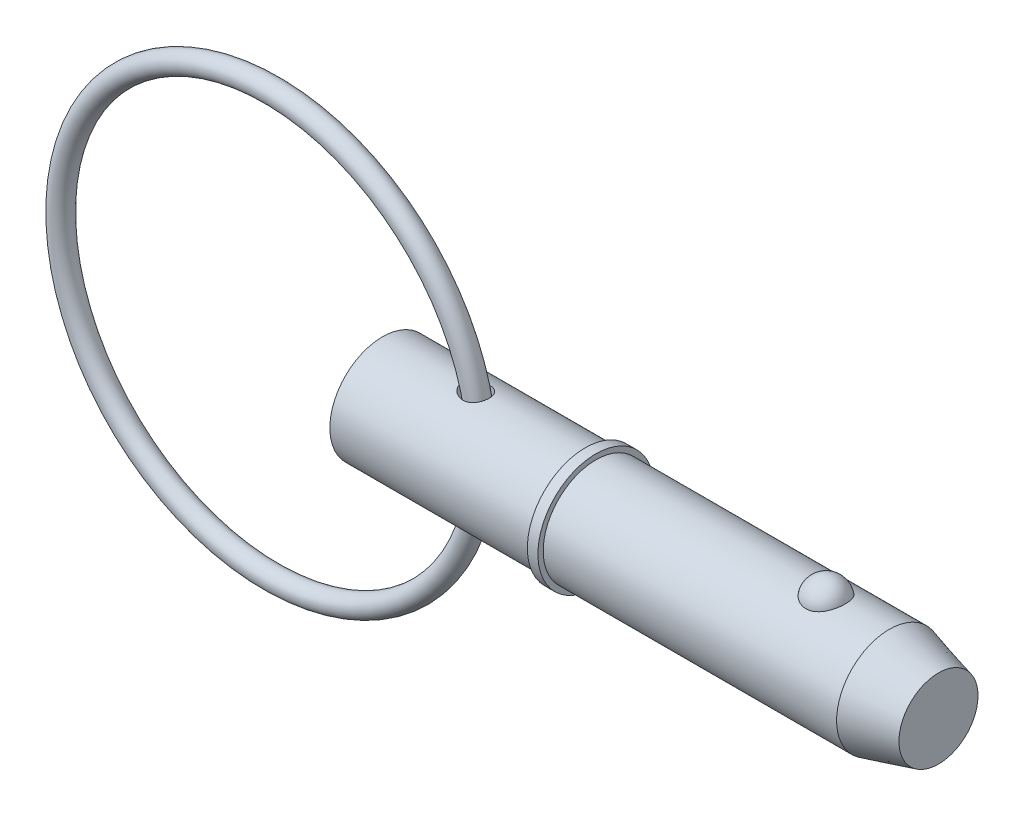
ISO-10303-21;
HEADER;
FILE_DESCRIPTION(('STEP AP214'),'2;1');
FILE_NAME('part.step','',(''),(''),'','','');
FILE_SCHEMA(('AUTOMOTIVE_DESIGN { 1 0 10303 214 1 1 1 1 }'));
ENDSEC;
DATA;
#1=APPLICATION_CONTEXT('core data for automotive mechanical design processes');
#2=APPLICATION_PROTOCOL_DEFINITION('international standard','automotive_design',2000,#1);
#3=PRODUCT_CONTEXT('',#1,'mechanical');
#4=PRODUCT('Part','Part','',(#3));
#5=PRODUCT_RELATED_PRODUCT_CATEGORY('part','',(#4));
#6=PRODUCT_DEFINITION_FORMATION('','',#4);
#7=PRODUCT_DEFINITION_CONTEXT('part definition',#1,'design');
#8=PRODUCT_DEFINITION('design','',#6,#7);
#9=PRODUCT_DEFINITION_SHAPE('','',#8);
#10=(LENGTH_UNIT() NAMED_UNIT(*) SI_UNIT(.MILLI.,.METRE.));
#11=(NAMED_UNIT(*) PLANE_ANGLE_UNIT() SI_UNIT($,.RADIAN.));
#12=(NAMED_UNIT(*) SI_UNIT($,.STERADIAN.) SOLID_ANGLE_UNIT());
#13=UNCERTAINTY_MEASURE_WITH_UNIT(LENGTH_MEASURE(1.E-05),#10,'distance_accuracy_value','');
#14=(GEOMETRIC_REPRESENTATION_CONTEXT(3) GLOBAL_UNCERTAINTY_ASSIGNED_CONTEXT((#13)) GLOBAL_UNIT_ASSIGNED_CONTEXT((#10,
#11,#12)) REPRESENTATION_CONTEXT('',''));
#15=CARTESIAN_POINT('',(0.,0.,0.));
#16=DIRECTION('',(0.,0.,1.));
#17=DIRECTION('',(1.,0.,0.));
#18=AXIS2_PLACEMENT_3D('',#15,#16,#17);
#19=CARTESIAN_POINT('',(-13.3798047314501,0.,0.));
#20=DIRECTION('',(0.,0.,1.));
#21=DIRECTION('',(1.,0.,0.));
#22=AXIS2_PLACEMENT_3D('',#19,#20,#21);
#23=TOROIDAL_SURFACE('',#22,25.4,1.27);
#24=CARTESIAN_POINT('',(13.2901952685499,0.,0.));
#25=VERTEX_POINT('',#24);
#26=VERTEX_LOOP('',#25);
#27=FACE_BOUND('',#26,.T.);
#28=ADVANCED_FACE('P0_F12',(#27),#23,.T.);
#29=CLOSED_SHELL('',(#28));
#30=MANIFOLD_SOLID_BREP('P0_B1',#29);
#31=CARTESIAN_POINT('',(0.,0.,0.));
#32=DIRECTION('',(1.,0.,0.));
#33=DIRECTION('',(0.,0.,-1.));
#34=AXIS2_PLACEMENT_3D('',#31,#32,#33);
#35=CYLINDRICAL_SURFACE('',#34,6.35);
#36=CARTESIAN_POINT('',(9.67500140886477,6.32698634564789,-0.540133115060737));
#37=CARTESIAN_POINT('',(9.70878953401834,6.3197498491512,-0.624879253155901));
#38=CARTESIAN_POINT('',(9.75028044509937,6.31105328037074,-0.706504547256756));
#39=CARTESIAN_POINT('',(9.84659255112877,6.29180070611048,-0.861319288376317));
#40=CARTESIAN_POINT('',(9.90144039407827,6.28124099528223,-0.934491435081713));
#41=CARTESIAN_POINT('',(10.021999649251,6.25949497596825,-1.0704877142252));
#42=CARTESIAN_POINT('',(10.0876589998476,6.2483118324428,-1.13335868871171));
#43=CARTESIAN_POINT('',(10.2280180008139,6.22641783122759,-1.24805262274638));
#44=CARTESIAN_POINT('',(10.3027159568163,6.21570688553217,-1.29987764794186));
#45=CARTESIAN_POINT('',(10.4650889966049,6.19509606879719,-1.39492899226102));
#46=CARTESIAN_POINT('',(10.5533142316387,6.1853135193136,-1.4372443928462));
#47=CARTESIAN_POINT('',(10.7357818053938,6.16871128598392,-1.50691441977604));
#48=CARTESIAN_POINT('',(10.8300253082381,6.16189217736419,-1.53426614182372));
#49=CARTESIAN_POINT('',(11.0227953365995,6.15211299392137,-1.57302798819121));
#50=CARTESIAN_POINT('',(11.1213511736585,6.14918579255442,-1.58430237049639));
#51=CARTESIAN_POINT('',(11.3189518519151,6.1478413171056,-1.58951619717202));
#52=CARTESIAN_POINT('',(11.417996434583,6.14942187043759,-1.58346399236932));
#53=CARTESIAN_POINT('',(11.6070859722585,6.15678569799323,-1.55457003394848));
#54=CARTESIAN_POINT('',(11.6973059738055,6.16229943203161,-1.53280404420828));
#55=CARTESIAN_POINT('',(11.8723373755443,6.17663058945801,-1.4739892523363));
#56=CARTESIAN_POINT('',(11.9571502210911,6.185447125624,-1.43694455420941));
#57=CARTESIAN_POINT('',(12.1146737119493,6.20482821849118,-1.35072170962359));
#58=CARTESIAN_POINT('',(12.1877743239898,6.21528554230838,-1.30222952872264));
#59=CARTESIAN_POINT('',(12.3246187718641,6.23705116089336,-1.19362916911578));
#60=CARTESIAN_POINT('',(12.3883628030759,6.24835943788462,-1.1335212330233));
#61=CARTESIAN_POINT('',(12.5046662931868,6.27053957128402,-1.00357204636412));
#62=CARTESIAN_POINT('',(12.5572571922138,6.28141258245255,-0.933759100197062));
#63=CARTESIAN_POINT('',(12.6502125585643,6.30157953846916,-0.786214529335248));
#64=CARTESIAN_POINT('',(12.6905764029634,6.31087340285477,-0.708482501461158));
#65=CARTESIAN_POINT('',(12.7585531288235,6.32699259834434,-0.546246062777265));
#66=CARTESIAN_POINT('',(12.7860022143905,6.33378599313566,-0.46166981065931));
#67=CARTESIAN_POINT('',(12.8267605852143,6.34401050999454,-0.288980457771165));
#68=CARTESIAN_POINT('',(12.8400695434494,6.34744155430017,-0.200867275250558));
#69=CARTESIAN_POINT('',(12.8522644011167,6.35058177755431,-0.023194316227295));
#70=CARTESIAN_POINT('',(12.8510870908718,6.35027464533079,0.0663700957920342));
#71=CARTESIAN_POINT('',(12.8341831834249,6.34593169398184,0.244024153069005));
#72=CARTESIAN_POINT('',(12.8184563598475,6.341895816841,0.332113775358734));
#73=CARTESIAN_POINT('',(12.7728208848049,6.33052992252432,0.504322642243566));
#74=CARTESIAN_POINT('',(12.7429114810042,6.32319973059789,0.58844167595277));
#75=CARTESIAN_POINT('',(12.6696162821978,6.30604116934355,0.750316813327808));
#76=CARTESIAN_POINT('',(12.6262302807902,6.29621276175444,0.828072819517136));
#77=CARTESIAN_POINT('',(12.5270856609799,6.27515240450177,0.974918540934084));
#78=CARTESIAN_POINT('',(12.4713403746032,6.26392197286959,1.04401746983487));
#79=CARTESIAN_POINT('',(12.3488662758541,6.24131002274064,1.1716478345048));
#80=CARTESIAN_POINT('',(12.2821384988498,6.22992851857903,1.23018026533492));
#81=CARTESIAN_POINT('',(12.1401870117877,6.20841765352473,1.33449214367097));
#82=CARTESIAN_POINT('',(12.0650507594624,6.19827734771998,1.38038832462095));
#83=CARTESIAN_POINT('',(11.9079044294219,6.18026478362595,1.45892404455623));
#84=CARTESIAN_POINT('',(11.8258951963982,6.17239224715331,1.49156520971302));
#85=CARTESIAN_POINT('',(11.6581736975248,6.15982613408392,1.54263810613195));
#86=CARTESIAN_POINT('',(11.572502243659,6.15510409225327,1.56119728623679));
#87=CARTESIAN_POINT('',(11.3991899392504,6.14916283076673,1.58443707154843));
#88=CARTESIAN_POINT('',(11.3115488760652,6.14794399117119,1.58911617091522));
#89=CARTESIAN_POINT('',(11.1345547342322,6.14904466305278,1.58485137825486));
#90=CARTESIAN_POINT('',(11.0452104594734,6.15144894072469,1.5755811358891));
#91=CARTESIAN_POINT('',(10.8691479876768,6.15957601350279,1.54349959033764));
#92=CARTESIAN_POINT('',(10.782430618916,6.16529984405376,1.52068406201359));
#93=CARTESIAN_POINT('',(10.6082848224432,6.17983892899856,1.4605156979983));
#94=CARTESIAN_POINT('',(10.5211557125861,6.1888262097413,1.42233764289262));
#95=CARTESIAN_POINT('',(10.3542377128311,6.20874782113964,1.33268652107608));
#96=CARTESIAN_POINT('',(10.2744521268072,6.21968302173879,1.28120750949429));
#97=CARTESIAN_POINT('',(10.120854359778,6.24282707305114,1.16334748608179));
#98=CARTESIAN_POINT('',(10.0474902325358,6.25507146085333,1.09638652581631));
#99=CARTESIAN_POINT('',(9.9136869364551,6.27890019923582,0.950453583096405));
#100=CARTESIAN_POINT('',(9.85324511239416,6.29048468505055,0.871484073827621));
#101=CARTESIAN_POINT('',(9.75037543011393,6.31102161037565,0.707140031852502));
#102=CARTESIAN_POINT('',(9.70726585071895,6.32006820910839,0.622206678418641));
#103=CARTESIAN_POINT('',(9.63775895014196,6.33497125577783,0.445490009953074));
#104=CARTESIAN_POINT('',(9.61134627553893,6.34083063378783,0.35371307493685));
#105=CARTESIAN_POINT('',(9.57891955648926,6.34807071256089,0.177220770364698));
#106=CARTESIAN_POINT('',(9.57093524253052,6.3498832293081,0.0928817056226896));
#107=CARTESIAN_POINT('',(9.56994851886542,6.35010532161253,-0.0758268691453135));
#108=CARTESIAN_POINT('',(9.57692695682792,6.34851924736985,-0.160196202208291));
#109=CARTESIAN_POINT('',(9.59985709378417,6.34339435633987,-0.294043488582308));
#110=CARTESIAN_POINT('',(9.61128951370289,6.34084912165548,-0.344385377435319));
#111=CARTESIAN_POINT('',(9.63933183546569,6.33468615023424,-0.443526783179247));
#112=CARTESIAN_POINT('',(9.65594100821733,6.33106856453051,-0.492326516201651));
#113=CARTESIAN_POINT('',(9.67500140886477,6.32698634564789,-0.540133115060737));
#114=B_SPLINE_CURVE_WITH_KNOTS('',3,(#36,#37,#38,#39,#40,#41,#42,#43,#44,#45,#46,#47,#48,#49,
#50,#51,#52,#53,#54,#55,#56,#57,#58,#59,#60,#61,#62,#63,#64,#65,#66,#67,#68,#69,#70,#71,#72,#73,
#74,#75,#76,#77,#78,#79,#80,#81,#82,#83,#84,#85,#86,#87,#88,#89,#90,#91,#92,#93,#94,#95,#96,#97,
#98,#99,#100,#101,#102,#103,#104,#105,#106,#107,#108,#109,#110,#111,#112,#113),.UNSPECIFIED.,
.T.,.F.,(4,2,2,2,2,2,2,2,2,2,2,2,2,2,2,2,2,2,2,2,2,2,2,2,2,2,2,2,2,2,2,2,2,2,2,2,2,2,4),(0.,
0.274348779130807,0.549249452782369,0.822863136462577,1.09642560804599,1.39007706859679,
1.68378550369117,1.97995934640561,2.27599046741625,2.55347281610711,2.83088067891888,
3.09465189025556,3.35841759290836,3.62142956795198,3.88445494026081,4.1507318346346,
4.4170148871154,4.68446025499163,4.95190978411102,5.21937350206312,5.48684131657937,
5.75402200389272,6.02117751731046,6.28577524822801,6.55034050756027,6.81248178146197,
7.0746514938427,7.34305086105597,7.61153399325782,7.89692981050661,8.18245340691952,
8.48120635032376,8.77989784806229,9.06530254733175,9.35044442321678,9.60331609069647,
9.85586427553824,10.010650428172,10.1654147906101),.UNSPECIFIED.);
#115=CARTESIAN_POINT('',(9.67500140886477,6.32698634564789,-0.540133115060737));
#116=VERTEX_POINT('',#115);
#117=EDGE_CURVE('P1_E42',#116,#116,#114,.T.);
#118=ORIENTED_EDGE('',*,*,#117,.T.);
#119=EDGE_LOOP('',(#118));
#120=FACE_BOUND('',#119,.T.);
#121=CARTESIAN_POINT('',(0.,0.,0.));
#122=DIRECTION('',(1.,0.,0.));
#123=DIRECTION('',(0.,0.,-1.));
#124=AXIS2_PLACEMENT_3D('',#121,#122,#123);
#125=CIRCLE('',#124,6.35);
#126=CARTESIAN_POINT('',(0.,0.,-6.35));
#127=VERTEX_POINT('',#126);
#128=EDGE_CURVE('P1_E9',#127,#127,#125,.T.);
#129=ORIENTED_EDGE('',*,*,#128,.T.);
#130=EDGE_LOOP('',(#129));
#131=FACE_BOUND('',#130,.T.);
#132=CARTESIAN_POINT('',(24.43,0.,0.));
#133=DIRECTION('',(1.,0.,0.));
#134=DIRECTION('',(0.,0.,-1.));
#135=AXIS2_PLACEMENT_3D('',#132,#133,#134);
#136=CIRCLE('',#135,6.35);
#137=CARTESIAN_POINT('',(24.43,0.,-6.35));
#138=VERTEX_POINT('',#137);
#139=EDGE_CURVE('P1_E25',#138,#138,#136,.T.);
#140=ORIENTED_EDGE('',*,*,#139,.F.);
#141=EDGE_LOOP('',(#140));
#142=FACE_BOUND('',#141,.T.);
#143=CARTESIAN_POINT('',(9.67500140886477,-6.32698634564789,-0.540133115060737));
#144=CARTESIAN_POINT('',(9.64544894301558,-6.33331515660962,-0.466002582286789));
#145=CARTESIAN_POINT('',(9.62177180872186,-6.33852974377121,-0.389437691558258));
#146=CARTESIAN_POINT('',(9.58727043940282,-6.34619174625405,-0.233330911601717));
#147=CARTESIAN_POINT('',(9.57644043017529,-6.34864040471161,-0.153790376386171));
#148=CARTESIAN_POINT('',(9.56819517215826,-6.3505010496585,0.00612071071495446));
#149=CARTESIAN_POINT('',(9.57079639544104,-6.34990930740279,0.0864921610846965));
#150=CARTESIAN_POINT('',(9.58930797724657,-6.3457478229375,0.245607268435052));
#151=CARTESIAN_POINT('',(9.60522046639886,-6.34217760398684,0.324350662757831));
#152=CARTESIAN_POINT('',(9.64931570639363,-6.3324977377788,0.47727605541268));
#153=CARTESIAN_POINT('',(9.67737525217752,-6.32641361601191,0.551495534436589));
#154=CARTESIAN_POINT('',(9.74451510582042,-6.31231128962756,0.694551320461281));
#155=CARTESIAN_POINT('',(9.78359827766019,-6.30429258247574,0.763386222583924));
#156=CARTESIAN_POINT('',(9.87474700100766,-6.28638332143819,0.899414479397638));
#157=CARTESIAN_POINT('',(9.92757481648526,-6.27639669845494,0.966083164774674));
#158=CARTESIAN_POINT('',(10.042675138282,-6.25596164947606,1.09061181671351));
#159=CARTESIAN_POINT('',(10.1049521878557,-6.24551300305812,1.14846751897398));
#160=CARTESIAN_POINT('',(10.2445505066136,-6.22397505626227,1.26024641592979));
#161=CARTESIAN_POINT('',(10.3227711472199,-6.2129394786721,1.31305951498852));
#162=CARTESIAN_POINT('',(10.4867924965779,-6.19263757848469,1.40570084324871));
#163=CARTESIAN_POINT('',(10.5725962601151,-6.18337197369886,1.44552380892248));
#164=CARTESIAN_POINT('',(10.7543302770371,-6.16725983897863,1.51283687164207));
#165=CARTESIAN_POINT('',(10.8505554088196,-6.16056505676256,1.53957358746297));
#166=CARTESIAN_POINT('',(11.0463546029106,-6.15127671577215,1.57628137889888));
#167=CARTESIAN_POINT('',(11.1459276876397,-6.14868197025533,1.58625730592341));
#168=CARTESIAN_POINT('',(11.3414257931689,-6.14810798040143,1.58848000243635));
#169=CARTESIAN_POINT('',(11.4373417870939,-6.14995283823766,1.58140242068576));
#170=CARTESIAN_POINT('',(11.6262783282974,-6.1577972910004,1.55057566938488));
#171=CARTESIAN_POINT('',(11.719300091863,-6.16379511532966,1.52683360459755));
#172=CARTESIAN_POINT('',(11.8934223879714,-6.17873566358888,1.46514575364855));
#173=CARTESIAN_POINT('',(11.9749048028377,-6.18746207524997,1.42822144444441));
#174=CARTESIAN_POINT('',(12.1301362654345,-6.20693584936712,1.3410564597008));
#175=CARTESIAN_POINT('',(12.2038861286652,-6.21768299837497,1.29081719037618));
#176=CARTESIAN_POINT('',(12.3399792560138,-6.23970077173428,1.17972764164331));
#177=CARTESIAN_POINT('',(12.4025430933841,-6.25095401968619,1.11914355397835));
#178=CARTESIAN_POINT('',(12.5166805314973,-6.27296916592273,0.988307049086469));
#179=CARTESIAN_POINT('',(12.568253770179,-6.28373104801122,0.918054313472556));
#180=CARTESIAN_POINT('',(12.6596230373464,-6.3037060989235,0.769081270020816));
#181=CARTESIAN_POINT('',(12.6992956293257,-6.31290263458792,0.690283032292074));
#182=CARTESIAN_POINT('',(12.7652258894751,-6.32862394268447,0.527011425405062));
#183=CARTESIAN_POINT('',(12.7914829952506,-6.33514860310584,0.442537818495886));
#184=CARTESIAN_POINT('',(12.8301436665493,-6.34487485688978,0.269505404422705));
#185=CARTESIAN_POINT('',(12.8424230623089,-6.34804664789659,0.180917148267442));
#186=CARTESIAN_POINT('',(12.8524214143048,-6.35062347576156,0.00286829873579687));
#187=CARTESIAN_POINT('',(12.8501402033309,-6.35002846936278,-0.0865923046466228));
#188=CARTESIAN_POINT('',(12.8310619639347,-6.34513332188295,-0.263931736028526));
#189=CARTESIAN_POINT('',(12.8142517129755,-6.34082980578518,-0.35180904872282));
#190=CARTESIAN_POINT('',(12.7664911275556,-6.32897674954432,-0.523406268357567));
#191=CARTESIAN_POINT('',(12.7355404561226,-6.3214271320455,-0.607126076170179));
#192=CARTESIAN_POINT('',(12.6602298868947,-6.30390232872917,-0.768030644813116));
#193=CARTESIAN_POINT('',(12.6158695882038,-6.29392707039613,-0.84521521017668));
#194=CARTESIAN_POINT('',(12.5148171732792,-6.2726521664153,-0.990836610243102));
#195=CARTESIAN_POINT('',(12.4581254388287,-6.26135256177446,-1.05927371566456));
#196=CARTESIAN_POINT('',(12.33416419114,-6.2387572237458,-1.18510935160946));
#197=CARTESIAN_POINT('',(12.2669484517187,-6.22746174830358,-1.24256086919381));
#198=CARTESIAN_POINT('',(12.1235592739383,-6.20610255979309,-1.34519464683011));
#199=CARTESIAN_POINT('',(12.0473871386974,-6.19603866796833,-1.39037868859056));
#200=CARTESIAN_POINT('',(11.8892714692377,-6.17839642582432,-1.46678006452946));
#201=CARTESIAN_POINT('',(11.8074126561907,-6.17078838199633,-1.49816605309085));
#202=CARTESIAN_POINT('',(11.6394563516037,-6.15869606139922,-1.54712759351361));
#203=CARTESIAN_POINT('',(11.5533589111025,-6.15421174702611,-1.56470331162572));
#204=CARTESIAN_POINT('',(11.3789660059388,-6.14876652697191,-1.58596734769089));
#205=CARTESIAN_POINT('',(11.2906621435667,-6.1478222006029,-1.58959032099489));
#206=CARTESIAN_POINT('',(11.1146029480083,-6.149490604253,-1.58312110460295));
#207=CARTESIAN_POINT('',(11.0268477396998,-6.1521041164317,-1.57302589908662));
#208=CARTESIAN_POINT('',(10.8498668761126,-6.16071031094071,-1.53898332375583));
#209=CARTESIAN_POINT('',(10.7607726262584,-6.16685908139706,-1.51439468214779));
#210=CARTESIAN_POINT('',(10.5876521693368,-6.18189031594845,-1.45181305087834));
#211=CARTESIAN_POINT('',(10.5036282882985,-6.19077402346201,-1.41381396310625));
#212=CARTESIAN_POINT('',(10.3374228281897,-6.2109378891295,-1.32252480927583));
#213=CARTESIAN_POINT('',(10.255708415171,-6.2223355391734,-1.26840756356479));
#214=CARTESIAN_POINT('',(10.1025645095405,-6.24580740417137,-1.14725208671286));
#215=CARTESIAN_POINT('',(10.0311354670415,-6.25788164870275,-1.08021329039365));
#216=CARTESIAN_POINT('',(9.90472699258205,-6.2806176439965,-0.938710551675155));
#217=CARTESIAN_POINT('',(9.84904456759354,-6.29132066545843,-0.864883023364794));
#218=CARTESIAN_POINT('',(9.75129345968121,-6.31084098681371,-0.708496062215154));
#219=CARTESIAN_POINT('',(9.70921094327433,-6.31966019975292,-0.625945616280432));
#220=CARTESIAN_POINT('',(9.67500140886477,-6.32698634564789,-0.540133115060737));
#221=B_SPLINE_CURVE_WITH_KNOTS('',3,(#143,#144,#145,#146,#147,#148,#149,#150,#151,#152,#153,
#154,#155,#156,#157,#158,#159,#160,#161,#162,#163,#164,#165,#166,#167,#168,#169,#170,#171,#172,
#173,#174,#175,#176,#177,#178,#179,#180,#181,#182,#183,#184,#185,#186,#187,#188,#189,#190,#191,
#192,#193,#194,#195,#196,#197,#198,#199,#200,#201,#202,#203,#204,#205,#206,#207,#208,#209,#210,
#211,#212,#213,#214,#215,#216,#217,#218,#219,#220),.UNSPECIFIED.,.T.,.F.,(4,2,2,2,2,2,2,2,2,2,2,
2,2,2,2,2,2,2,2,2,2,2,2,2,2,2,2,2,2,2,2,2,2,2,2,2,2,2,4),(0.,0.239871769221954,
0.479635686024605,0.719693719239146,0.959790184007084,1.19750645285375,1.43528453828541,
1.69117930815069,1.94719750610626,2.23102979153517,2.51497694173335,2.81376497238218,
3.11246650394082,3.39952951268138,3.68647020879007,3.95479420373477,4.22308987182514,
4.48530700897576,4.74753278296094,5.01239119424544,5.27726070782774,5.54446524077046,
5.81167284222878,6.07912387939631,6.34658129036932,6.61404669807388,6.88150382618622,
7.14763644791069,7.41373039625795,7.67647472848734,7.93921589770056,8.20318607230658,
8.46721428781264,8.74390821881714,9.02072813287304,9.31537622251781,9.61003720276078,
9.88799314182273,10.1656654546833),.UNSPECIFIED.);
#222=CARTESIAN_POINT('',(9.67500140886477,-6.32698634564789,-0.540133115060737));
#223=VERTEX_POINT('',#222);
#224=EDGE_CURVE('P1_E17',#223,#223,#221,.T.);
#225=ORIENTED_EDGE('',*,*,#224,.T.);
#226=EDGE_LOOP('',(#225));
#227=FACE_BOUND('',#226,.T.);
#228=ADVANCED_FACE('P1_F13',(#120,#131,#142,#227),#35,.T.);
#229=CARTESIAN_POINT('',(0.,0.,0.));
#230=DIRECTION('',(1.,0.,0.));
#231=DIRECTION('',(0.,0.,-1.));
#232=AXIS2_PLACEMENT_3D('',#229,#230,#231);
#233=CYLINDRICAL_SURFACE('',#232,6.35);
#234=CARTESIAN_POINT('',(61.0553693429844,0.,0.));
#235=DIRECTION('',(1.,0.,0.));
#236=DIRECTION('',(0.,0.,-1.));
#237=AXIS2_PLACEMENT_3D('',#234,#235,#236);
#238=CIRCLE('',#237,6.35);
#239=CARTESIAN_POINT('',(61.0553693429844,0.,-6.35));
#240=VERTEX_POINT('',#239);
#241=EDGE_CURVE('P1_E99',#240,#240,#238,.T.);
#242=ORIENTED_EDGE('',*,*,#241,.F.);
#243=EDGE_LOOP('',(#242));
#244=FACE_BOUND('',#243,.T.);
#245=CARTESIAN_POINT('',(25.7,0.,0.));
#246=DIRECTION('',(1.,0.,0.));
#247=DIRECTION('',(0.,0.,-1.));
#248=AXIS2_PLACEMENT_3D('',#245,#246,#247);
#249=CIRCLE('',#248,6.35);
#250=CARTESIAN_POINT('',(25.7,0.,-6.35));
#251=VERTEX_POINT('',#250);
#252=EDGE_CURVE('P1_E96',#251,#251,#249,.T.);
#253=ORIENTED_EDGE('',*,*,#252,.T.);
#254=EDGE_LOOP('',(#253));
#255=FACE_BOUND('',#254,.T.);
#256=CARTESIAN_POINT('',(53.4300214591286,5.87502187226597,2.40969251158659));
#257=CARTESIAN_POINT('',(53.3050305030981,5.87501645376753,2.40969773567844));
#258=CARTESIAN_POINT('',(53.1800806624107,5.87916061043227,2.39967292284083));
#259=CARTESIAN_POINT('',(52.9339091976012,5.8952311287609,2.3599173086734));
#260=CARTESIAN_POINT('',(52.8126863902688,5.90715499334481,2.33019283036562));
#261=CARTESIAN_POINT('',(52.5775170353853,5.93739567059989,2.25201402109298));
#262=CARTESIAN_POINT('',(52.4635602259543,5.95570321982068,2.20358681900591));
#263=CARTESIAN_POINT('',(52.24557352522,5.99672067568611,2.08937987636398));
#264=CARTESIAN_POINT('',(52.1415457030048,6.01943149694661,2.02359652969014));
#265=CARTESIAN_POINT('',(51.9429437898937,6.06760647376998,1.87428969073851));
#266=CARTESIAN_POINT('',(51.8487268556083,6.09313095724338,1.79031110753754));
#267=CARTESIAN_POINT('',(51.6752557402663,6.14375873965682,1.60800178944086));
#268=CARTESIAN_POINT('',(51.5960043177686,6.16886196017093,1.50966841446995));
#269=CARTESIAN_POINT('',(51.4508457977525,6.21724600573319,1.29645884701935));
#270=CARTESIAN_POINT('',(51.3856885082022,6.24039621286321,1.18104158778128));
#271=CARTESIAN_POINT('',(51.2747035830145,6.28117277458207,0.940351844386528));
#272=CARTESIAN_POINT('',(51.2288776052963,6.29879865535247,0.815078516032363));
#273=CARTESIAN_POINT('',(51.1570234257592,6.32692073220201,0.556494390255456));
#274=CARTESIAN_POINT('',(51.131249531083,6.33732517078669,0.423102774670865));
#275=CARTESIAN_POINT('',(51.1009885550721,6.34957673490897,0.15354272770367));
#276=CARTESIAN_POINT('',(51.0965009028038,6.35142408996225,0.0173743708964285));
#277=CARTESIAN_POINT('',(51.1088655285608,6.34638925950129,-0.25303667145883));
#278=CARTESIAN_POINT('',(51.1255949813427,6.33955731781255,-0.387285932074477));
#279=CARTESIAN_POINT('',(51.179843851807,6.31794129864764,-0.650851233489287));
#280=CARTESIAN_POINT('',(51.2173636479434,6.30315707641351,-0.780167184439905));
#281=CARTESIAN_POINT('',(51.312500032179,6.26711642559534,-1.03041949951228));
#282=CARTESIAN_POINT('',(51.370143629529,6.24585130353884,-1.15134433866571));
#283=CARTESIAN_POINT('',(51.5043522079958,6.19905619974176,-1.38129800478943));
#284=CARTESIAN_POINT('',(51.5809187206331,6.17352587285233,-1.49032586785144));
#285=CARTESIAN_POINT('',(51.7517538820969,6.12080227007,-1.69393164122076));
#286=CARTESIAN_POINT('',(51.8461008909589,6.09360200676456,-1.78844209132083));
#287=CARTESIAN_POINT('',(52.0501196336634,6.04070434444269,-1.95970536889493));
#288=CARTESIAN_POINT('',(52.1597900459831,6.01500681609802,-2.03645972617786));
#289=CARTESIAN_POINT('',(52.3891876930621,5.96867714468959,-2.1684564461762));
#290=CARTESIAN_POINT('',(52.5086522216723,5.94794910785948,-2.2241206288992));
#291=CARTESIAN_POINT('',(52.7562188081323,5.91340580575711,-2.31440992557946));
#292=CARTESIAN_POINT('',(52.8843175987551,5.89958794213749,-2.3490429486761));
#293=CARTESIAN_POINT('',(53.138582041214,5.88111049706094,-2.39491590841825));
#294=CARTESIAN_POINT('',(53.2645207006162,5.87602512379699,-2.40724512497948));
#295=CARTESIAN_POINT('',(53.5167867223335,5.87428980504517,-2.41147867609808));
#296=CARTESIAN_POINT('',(53.643114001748,5.87763817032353,-2.40338710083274));
#297=CARTESIAN_POINT('',(53.8884170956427,5.89212921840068,-2.367627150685));
#298=CARTESIAN_POINT('',(54.0074992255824,5.90302431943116,-2.34058030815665));
#299=CARTESIAN_POINT('',(54.2392447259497,5.93113752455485,-2.26839066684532));
#300=CARTESIAN_POINT('',(54.3519075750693,5.94835614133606,-2.22324640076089));
#301=CARTESIAN_POINT('',(54.5704009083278,5.98773016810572,-2.11493806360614));
#302=CARTESIAN_POINT('',(54.676028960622,6.00998499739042,-2.05140269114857));
#303=CARTESIAN_POINT('',(54.8753006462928,6.05690144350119,-1.90842705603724));
#304=CARTESIAN_POINT('',(54.9689415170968,6.08156361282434,-1.82898313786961));
#305=CARTESIAN_POINT('',(55.1466754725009,6.13211715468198,-1.65182429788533));
#306=CARTESIAN_POINT('',(55.230055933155,6.15800825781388,-1.55339381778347));
#307=CARTESIAN_POINT('',(55.3797900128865,6.20712834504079,-1.34374214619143));
#308=CARTESIAN_POINT('',(55.4461405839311,6.23035685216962,-1.23251867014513));
#309=CARTESIAN_POINT('',(55.5623455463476,6.27251177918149,-0.996447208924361));
#310=CARTESIAN_POINT('',(55.6116072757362,6.29127762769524,-0.87127812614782));
#311=CARTESIAN_POINT('',(55.6896142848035,6.3215862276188,-0.613870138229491));
#312=CARTESIAN_POINT('',(55.718359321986,6.33312889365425,-0.481631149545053));
#313=CARTESIAN_POINT('',(55.7547705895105,6.34782349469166,-0.213672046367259));
#314=CARTESIAN_POINT('',(55.7624134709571,6.35096613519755,-0.0779482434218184));
#315=CARTESIAN_POINT('',(55.7563951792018,6.34851322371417,0.192943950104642));
#316=CARTESIAN_POINT('',(55.7427343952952,6.3429178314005,0.328112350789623));
#317=CARTESIAN_POINT('',(55.6945036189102,6.32360512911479,0.593406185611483));
#318=CARTESIAN_POINT('',(55.6600313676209,6.30992579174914,0.723552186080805));
#319=CARTESIAN_POINT('',(55.5709539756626,6.27586325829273,0.975834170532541));
#320=CARTESIAN_POINT('',(55.5163476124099,6.25547965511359,1.09796966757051));
#321=CARTESIAN_POINT('',(55.3877587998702,6.20998183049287,1.33148921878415));
#322=CARTESIAN_POINT('',(55.3136742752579,6.18484288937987,1.44281227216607));
#323=CARTESIAN_POINT('',(55.1478204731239,6.13258735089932,1.65087683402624));
#324=CARTESIAN_POINT('',(55.0560515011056,6.10547078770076,1.74761859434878));
#325=CARTESIAN_POINT('',(54.8571839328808,6.0523587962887,1.92350926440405));
#326=CARTESIAN_POINT('',(54.750133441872,6.0263601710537,2.00271146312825));
#327=CARTESIAN_POINT('',(54.5231384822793,5.97843747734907,2.14154159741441));
#328=CARTESIAN_POINT('',(54.403191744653,5.95651412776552,2.20116608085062));
#329=CARTESIAN_POINT('',(54.1445236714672,5.91812106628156,2.30250570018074));
#330=CARTESIAN_POINT('',(54.0050698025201,5.90217533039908,2.34256795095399));
#331=CARTESIAN_POINT('',(53.7203974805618,5.88063128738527,2.39615214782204));
#332=CARTESIAN_POINT('',(53.5751817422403,5.8750281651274,2.40968644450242));
#333=CARTESIAN_POINT('',(53.4300214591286,5.87502187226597,2.40969251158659));
#334=B_SPLINE_CURVE_WITH_KNOTS('',3,(#256,#257,#258,#259,#260,#261,#262,#263,#264,#265,#266,
#267,#268,#269,#270,#271,#272,#273,#274,#275,#276,#277,#278,#279,#280,#281,#282,#283,#284,#285,
#286,#287,#288,#289,#290,#291,#292,#293,#294,#295,#296,#297,#298,#299,#300,#301,#302,#303,#304,
#305,#306,#307,#308,#309,#310,#311,#312,#313,#314,#315,#316,#317,#318,#319,#320,#321,#322,#323,
#324,#325,#326,#327,#328,#329,#330,#331,#332,#333),.UNSPECIFIED.,.T.,.F.,(4,2,2,2,2,2,2,2,2,2,2,
2,2,2,2,2,2,2,2,2,2,2,2,2,2,2,2,2,2,2,2,2,2,2,2,2,2,2,4),(0.,0.374440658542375,
0.748761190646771,1.12254078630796,1.49639810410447,1.88098871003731,2.26565013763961,
2.66741104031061,3.06920639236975,3.47601794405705,3.88281858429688,4.28727498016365,
4.69173873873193,5.09674745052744,5.50178895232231,5.90865911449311,6.31549420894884,
6.71369855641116,7.11175305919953,7.48978077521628,7.86773278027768,8.23383886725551,
8.59997464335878,8.97409044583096,9.34829231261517,9.74122667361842,10.1342313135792,
10.5397522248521,10.9452779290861,11.3512521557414,11.7572189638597,12.1612938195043,
12.5653932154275,12.9716540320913,13.3779078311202,13.7829098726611,14.1879832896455,
14.6230486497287,15.0579114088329),.UNSPECIFIED.);
#335=CARTESIAN_POINT('',(53.4300214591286,5.87502187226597,2.40969251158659));
#336=VERTEX_POINT('',#335);
#337=EDGE_CURVE('P1_E34',#336,#336,#334,.T.);
#338=ORIENTED_EDGE('',*,*,#337,.T.);
#339=EDGE_LOOP('',(#338));
#340=FACE_BOUND('',#339,.T.);
#341=ADVANCED_FACE('P1_F46',(#244,#255,#340),#233,.T.);
#342=CARTESIAN_POINT('',(0.,0.,0.));
#343=DIRECTION('',(-1.,0.,0.));
#344=DIRECTION('',(0.,0.,1.));
#345=AXIS2_PLACEMENT_3D('',#342,#343,#344);
#346=PLANE('',#345);
#347=ORIENTED_EDGE('',*,*,#128,.F.);
#348=EDGE_LOOP('',(#347));
#349=FACE_BOUND('',#348,.T.);
#350=ADVANCED_FACE('P1_F15',(#349),#346,.T.);
#351=CARTESIAN_POINT('',(24.43,6.35,0.));
#352=DIRECTION('',(-1.,0.,0.));
#353=DIRECTION('',(0.,0.,1.));
#354=AXIS2_PLACEMENT_3D('',#351,#352,#353);
#355=PLANE('',#354);
#356=ORIENTED_EDGE('',*,*,#139,.T.);
#357=EDGE_LOOP('',(#356));
#358=FACE_BOUND('',#357,.T.);
#359=CARTESIAN_POINT('',(24.43,0.,0.));
#360=DIRECTION('',(1.,0.,0.));
#361=DIRECTION('',(0.,0.,-1.));
#362=AXIS2_PLACEMENT_3D('',#359,#360,#361);
#363=CIRCLE('',#362,6.985);
#364=CARTESIAN_POINT('',(24.43,0.,-6.985));
#365=VERTEX_POINT('',#364);
#366=EDGE_CURVE('P1_E30',#365,#365,#363,.T.);
#367=ORIENTED_EDGE('',*,*,#366,.F.);
#368=EDGE_LOOP('',(#367));
#369=FACE_BOUND('',#368,.T.);
#370=ADVANCED_FACE('P1_F81',(#358,#369),#355,.T.);
#371=CARTESIAN_POINT('',(0.,0.,0.));
#372=DIRECTION('',(1.,0.,0.));
#373=DIRECTION('',(0.,0.,-1.));
#374=AXIS2_PLACEMENT_3D('',#371,#372,#373);
#375=CYLINDRICAL_SURFACE('',#374,6.985);
#376=ORIENTED_EDGE('',*,*,#366,.T.);
#377=EDGE_LOOP('',(#376));
#378=FACE_BOUND('',#377,.T.);
#379=CARTESIAN_POINT('',(25.7,0.,0.));
#380=DIRECTION('',(1.,0.,0.));
#381=DIRECTION('',(0.,0.,-1.));
#382=AXIS2_PLACEMENT_3D('',#379,#380,#381);
#383=CIRCLE('',#382,6.985);
#384=CARTESIAN_POINT('',(25.7,0.,-6.985));
#385=VERTEX_POINT('',#384);
#386=EDGE_CURVE('P1_E95',#385,#385,#383,.T.);
#387=ORIENTED_EDGE('',*,*,#386,.F.);
#388=EDGE_LOOP('',(#387));
#389=FACE_BOUND('',#388,.T.);
#390=ADVANCED_FACE('P1_F68',(#378,#389),#375,.T.);
#391=CARTESIAN_POINT('',(25.7,6.985,0.));
#392=DIRECTION('',(1.,0.,0.));
#393=DIRECTION('',(0.,0.,-1.));
#394=AXIS2_PLACEMENT_3D('',#391,#392,#393);
#395=PLANE('',#394);
#396=ORIENTED_EDGE('',*,*,#386,.T.);
#397=EDGE_LOOP('',(#396));
#398=FACE_BOUND('',#397,.T.);
#399=ORIENTED_EDGE('',*,*,#252,.F.);
#400=EDGE_LOOP('',(#399));
#401=FACE_BOUND('',#400,.T.);
#402=ADVANCED_FACE('P1_F62',(#398,#401),#395,.T.);
#403=CARTESIAN_POINT('',(66.98,0.,0.));
#404=DIRECTION('',(-1.,0.,0.));
#405=DIRECTION('',(0.,0.,1.));
#406=AXIS2_PLACEMENT_3D('',#403,#404,#405);
#407=CONICAL_SURFACE('',#406,4.76250000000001,0.26179938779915);
#408=ORIENTED_EDGE('',*,*,#241,.T.);
#409=EDGE_LOOP('',(#408));
#410=FACE_BOUND('',#409,.T.);
#411=CARTESIAN_POINT('',(66.98,0.,0.));
#412=DIRECTION('',(1.,0.,0.));
#413=DIRECTION('',(0.,0.,-1.));
#414=AXIS2_PLACEMENT_3D('',#411,#412,#413);
#415=CIRCLE('',#414,4.76250000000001);
#416=CARTESIAN_POINT('',(66.98,0.,-4.76250000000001));
#417=VERTEX_POINT('',#416);
#418=EDGE_CURVE('P1_E41',#417,#417,#415,.T.);
#419=ORIENTED_EDGE('',*,*,#418,.F.);
#420=EDGE_LOOP('',(#419));
#421=FACE_BOUND('',#420,.T.);
#422=ADVANCED_FACE('P1_F59',(#410,#421),#407,.T.);
#423=CARTESIAN_POINT('',(66.98,4.76250000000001,0.));
#424=DIRECTION('',(1.,0.,0.));
#425=DIRECTION('',(0.,0.,-1.));
#426=AXIS2_PLACEMENT_3D('',#423,#424,#425);
#427=PLANE('',#426);
#428=ORIENTED_EDGE('',*,*,#418,.T.);
#429=EDGE_LOOP('',(#428));
#430=FACE_BOUND('',#429,.T.);
#431=ADVANCED_FACE('P1_F55',(#430),#427,.T.);
#432=CARTESIAN_POINT('',(53.4300214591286,5.715,0.));
#433=DIRECTION('',(-1.,0.,0.));
#434=DIRECTION('',(0.,1.,0.));
#435=AXIS2_PLACEMENT_3D('',#432,#433,#434);
#436=SPHERICAL_SURFACE('',#435,2.415);
#437=ORIENTED_EDGE('',*,*,#337,.F.);
#438=EDGE_LOOP('',(#437));
#439=FACE_BOUND('',#438,.T.);
#440=ADVANCED_FACE('P1_F50',(#439),#436,.T.);
#441=CARTESIAN_POINT('',(-13.3798047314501,0.,0.));
#442=DIRECTION('',(0.,0.,1.));
#443=DIRECTION('',(1.,0.,0.));
#444=AXIS2_PLACEMENT_3D('',#441,#442,#443);
#445=TOROIDAL_SURFACE('',#444,25.4,1.5875);
#446=ORIENTED_EDGE('',*,*,#224,.F.);
#447=EDGE_LOOP('',(#446));
#448=FACE_BOUND('',#447,.T.);
#449=ORIENTED_EDGE('',*,*,#117,.F.);
#450=EDGE_LOOP('',(#449));
#451=FACE_BOUND('',#450,.T.);
#452=ADVANCED_FACE('P1_F54',(#448,#451),#445,.F.);
#453=CLOSED_SHELL('',(#228,#341,#350,#370,#390,#402,#422,#431,#440,#452));
#454=MANIFOLD_SOLID_BREP('P1_B1',#453);
#455=ADVANCED_BREP_SHAPE_REPRESENTATION('',(#18,#30,#454),#14);
#456=SHAPE_DEFINITION_REPRESENTATION(#9,#455);
ENDSEC;
END-ISO-10303-21;
